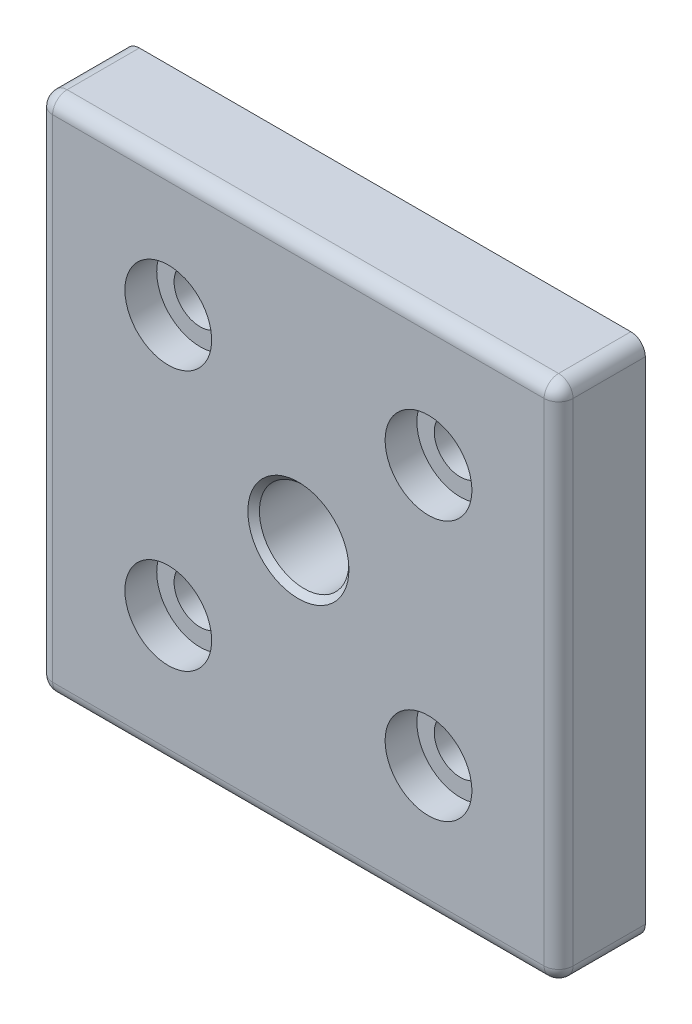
ISO-10303-21;
HEADER;
FILE_DESCRIPTION(('STEP AP214'),'2;1');
FILE_NAME('part.step','',(''),(''),'','','');
FILE_SCHEMA(('AUTOMOTIVE_DESIGN { 1 0 10303 214 1 1 1 1 }'));
ENDSEC;
DATA;
#1=APPLICATION_CONTEXT('core data for automotive mechanical design processes');
#2=APPLICATION_PROTOCOL_DEFINITION('international standard','automotive_design',2000,#1);
#3=PRODUCT_CONTEXT('',#1,'mechanical');
#4=PRODUCT('Part','Part','',(#3));
#5=PRODUCT_RELATED_PRODUCT_CATEGORY('part','',(#4));
#6=PRODUCT_DEFINITION_FORMATION('','',#4);
#7=PRODUCT_DEFINITION_CONTEXT('part definition',#1,'design');
#8=PRODUCT_DEFINITION('design','',#6,#7);
#9=PRODUCT_DEFINITION_SHAPE('','',#8);
#10=(LENGTH_UNIT() NAMED_UNIT(*) SI_UNIT(.MILLI.,.METRE.));
#11=(NAMED_UNIT(*) PLANE_ANGLE_UNIT() SI_UNIT($,.RADIAN.));
#12=(NAMED_UNIT(*) SI_UNIT($,.STERADIAN.) SOLID_ANGLE_UNIT());
#13=UNCERTAINTY_MEASURE_WITH_UNIT(LENGTH_MEASURE(1.E-05),#10,'distance_accuracy_value','');
#14=(GEOMETRIC_REPRESENTATION_CONTEXT(3) GLOBAL_UNCERTAINTY_ASSIGNED_CONTEXT((#13)) GLOBAL_UNIT_ASSIGNED_CONTEXT((#10,
#11,#12)) REPRESENTATION_CONTEXT('',''));
#15=CARTESIAN_POINT('',(0.,0.,0.));
#16=DIRECTION('',(0.,0.,1.));
#17=DIRECTION('',(1.,0.,0.));
#18=AXIS2_PLACEMENT_3D('',#15,#16,#17);
#19=CARTESIAN_POINT('',(0.,0.,15.));
#20=DIRECTION('',(0.,0.,1.));
#21=DIRECTION('',(1.,0.,0.));
#22=AXIS2_PLACEMENT_3D('',#19,#20,#21);
#23=PLANE('',#22);
#24=CARTESIAN_POINT('',(0.,0.,15.0000000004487));
#25=DIRECTION('',(0.,0.,1.));
#26=DIRECTION('',(0.,-1.,0.));
#27=AXIS2_PLACEMENT_3D('',#24,#25,#26);
#28=CIRCLE('',#27,8.73906249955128);
#29=CARTESIAN_POINT('',(0.,-8.73906249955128,15.0000000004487));
#30=VERTEX_POINT('',#29);
#31=EDGE_CURVE('E119',#30,#30,#28,.F.);
#32=ORIENTED_EDGE('',*,*,#31,.T.);
#33=EDGE_LOOP('',(#32));
#34=FACE_BOUND('',#33,.T.);
#35=CARTESIAN_POINT('',(22.5,-22.5,15.));
#36=DIRECTION('',(0.,0.,-1.));
#37=DIRECTION('',(-1.,0.,0.));
#38=AXIS2_PLACEMENT_3D('',#35,#36,#37);
#39=CIRCLE('',#38,7.5);
#40=CARTESIAN_POINT('',(15.,-22.5,15.));
#41=VERTEX_POINT('',#40);
#42=EDGE_CURVE('E123',#41,#41,#39,.T.);
#43=ORIENTED_EDGE('',*,*,#42,.T.);
#44=EDGE_LOOP('',(#43));
#45=FACE_BOUND('',#44,.T.);
#46=CARTESIAN_POINT('',(-22.5,-22.5,15.));
#47=DIRECTION('',(0.,0.,-1.));
#48=DIRECTION('',(-1.,0.,0.));
#49=AXIS2_PLACEMENT_3D('',#46,#47,#48);
#50=CIRCLE('',#49,7.5);
#51=CARTESIAN_POINT('',(-30.,-22.5,15.));
#52=VERTEX_POINT('',#51);
#53=EDGE_CURVE('E127',#52,#52,#50,.T.);
#54=ORIENTED_EDGE('',*,*,#53,.T.);
#55=EDGE_LOOP('',(#54));
#56=FACE_BOUND('',#55,.T.);
#57=CARTESIAN_POINT('',(-22.5,22.5,15.));
#58=DIRECTION('',(0.,0.,-1.));
#59=DIRECTION('',(-1.,0.,0.));
#60=AXIS2_PLACEMENT_3D('',#57,#58,#59);
#61=CIRCLE('',#60,7.5);
#62=CARTESIAN_POINT('',(-30.,22.5,15.));
#63=VERTEX_POINT('',#62);
#64=EDGE_CURVE('E19',#63,#63,#61,.T.);
#65=ORIENTED_EDGE('',*,*,#64,.T.);
#66=EDGE_LOOP('',(#65));
#67=FACE_BOUND('',#66,.T.);
#68=CARTESIAN_POINT('',(22.5,22.5,15.));
#69=DIRECTION('',(0.,0.,-1.));
#70=DIRECTION('',(-1.,0.,0.));
#71=AXIS2_PLACEMENT_3D('',#68,#69,#70);
#72=CIRCLE('',#71,7.5);
#73=CARTESIAN_POINT('',(15.,22.5,15.));
#74=VERTEX_POINT('',#73);
#75=EDGE_CURVE('E129',#74,#74,#72,.T.);
#76=ORIENTED_EDGE('',*,*,#75,.T.);
#77=EDGE_LOOP('',(#76));
#78=FACE_BOUND('',#77,.T.);
#79=DIRECTION('',(-1.,0.,0.));
#80=VECTOR('',#79,1.);
#81=CARTESIAN_POINT('',(22.5,-42.5,15.));
#82=LINE('',#81,#80);
#83=CARTESIAN_POINT('',(42.5,-42.5,15.));
#84=VERTEX_POINT('',#83);
#85=CARTESIAN_POINT('',(-42.5,-42.5,15.));
#86=VERTEX_POINT('',#85);
#87=EDGE_CURVE('E362',#84,#86,#82,.T.);
#88=ORIENTED_EDGE('',*,*,#87,.F.);
#89=DIRECTION('',(0.,-1.,0.));
#90=VECTOR('',#89,1.);
#91=CARTESIAN_POINT('',(42.5,22.5,15.));
#92=LINE('',#91,#90);
#93=CARTESIAN_POINT('',(42.5,42.5,15.));
#94=VERTEX_POINT('',#93);
#95=EDGE_CURVE('E229',#94,#84,#92,.T.);
#96=ORIENTED_EDGE('',*,*,#95,.F.);
#97=DIRECTION('',(1.,0.,0.));
#98=VECTOR('',#97,1.);
#99=CARTESIAN_POINT('',(-22.5,42.5,15.));
#100=LINE('',#99,#98);
#101=CARTESIAN_POINT('',(-42.5,42.5,15.));
#102=VERTEX_POINT('',#101);
#103=EDGE_CURVE('E126',#102,#94,#100,.T.);
#104=ORIENTED_EDGE('',*,*,#103,.F.);
#105=DIRECTION('',(0.,1.,0.));
#106=VECTOR('',#105,1.);
#107=CARTESIAN_POINT('',(-42.5,-22.5,15.));
#108=LINE('',#107,#106);
#109=EDGE_CURVE('E272',#86,#102,#108,.T.);
#110=ORIENTED_EDGE('',*,*,#109,.F.);
#111=EDGE_LOOP('',(#88,#96,#104,#110));
#112=FACE_BOUND('',#111,.T.);
#113=ADVANCED_FACE('F15',(#34,#45,#56,#67,#78,#112),#23,.T.);
#114=CARTESIAN_POINT('',(-22.5,22.5,15.));
#115=DIRECTION('',(0.,0.,-1.));
#116=DIRECTION('',(-1.,0.,0.));
#117=AXIS2_PLACEMENT_3D('',#114,#115,#116);
#118=CYLINDRICAL_SURFACE('',#117,7.5);
#119=CARTESIAN_POINT('',(-22.5,22.5,9.5));
#120=DIRECTION('',(0.,0.,-1.));
#121=DIRECTION('',(-1.,0.,0.));
#122=AXIS2_PLACEMENT_3D('',#119,#120,#121);
#123=CIRCLE('',#122,7.5);
#124=CARTESIAN_POINT('',(-30.,22.5,9.5));
#125=VERTEX_POINT('',#124);
#126=EDGE_CURVE('E116',#125,#125,#123,.T.);
#127=ORIENTED_EDGE('',*,*,#126,.T.);
#128=EDGE_LOOP('',(#127));
#129=FACE_BOUND('',#128,.T.);
#130=ORIENTED_EDGE('',*,*,#64,.F.);
#131=EDGE_LOOP('',(#130));
#132=FACE_BOUND('',#131,.T.);
#133=ADVANCED_FACE('F137',(#129,#132),#118,.F.);
#134=CARTESIAN_POINT('',(22.5,22.5,15.));
#135=DIRECTION('',(0.,0.,-1.));
#136=DIRECTION('',(-1.,0.,0.));
#137=AXIS2_PLACEMENT_3D('',#134,#135,#136);
#138=CYLINDRICAL_SURFACE('',#137,7.5);
#139=CARTESIAN_POINT('',(22.5,22.5,9.5));
#140=DIRECTION('',(0.,0.,-1.));
#141=DIRECTION('',(-1.,0.,0.));
#142=AXIS2_PLACEMENT_3D('',#139,#140,#141);
#143=CIRCLE('',#142,7.5);
#144=CARTESIAN_POINT('',(15.,22.5,9.5));
#145=VERTEX_POINT('',#144);
#146=EDGE_CURVE('E113',#145,#145,#143,.T.);
#147=ORIENTED_EDGE('',*,*,#146,.T.);
#148=EDGE_LOOP('',(#147));
#149=FACE_BOUND('',#148,.T.);
#150=ORIENTED_EDGE('',*,*,#75,.F.);
#151=EDGE_LOOP('',(#150));
#152=FACE_BOUND('',#151,.T.);
#153=ADVANCED_FACE('F139',(#149,#152),#138,.F.);
#154=CARTESIAN_POINT('',(-22.5,-22.5,15.));
#155=DIRECTION('',(0.,0.,-1.));
#156=DIRECTION('',(-1.,0.,0.));
#157=AXIS2_PLACEMENT_3D('',#154,#155,#156);
#158=CYLINDRICAL_SURFACE('',#157,7.5);
#159=CARTESIAN_POINT('',(-22.5,-22.5,9.5));
#160=DIRECTION('',(0.,0.,-1.));
#161=DIRECTION('',(-1.,0.,0.));
#162=AXIS2_PLACEMENT_3D('',#159,#160,#161);
#163=CIRCLE('',#162,7.5);
#164=CARTESIAN_POINT('',(-30.,-22.5,9.5));
#165=VERTEX_POINT('',#164);
#166=EDGE_CURVE('E110',#165,#165,#163,.T.);
#167=ORIENTED_EDGE('',*,*,#166,.T.);
#168=EDGE_LOOP('',(#167));
#169=FACE_BOUND('',#168,.T.);
#170=ORIENTED_EDGE('',*,*,#53,.F.);
#171=EDGE_LOOP('',(#170));
#172=FACE_BOUND('',#171,.T.);
#173=ADVANCED_FACE('F147',(#169,#172),#158,.F.);
#174=CARTESIAN_POINT('',(22.5,-22.5,15.));
#175=DIRECTION('',(0.,0.,-1.));
#176=DIRECTION('',(-1.,0.,0.));
#177=AXIS2_PLACEMENT_3D('',#174,#175,#176);
#178=CYLINDRICAL_SURFACE('',#177,7.5);
#179=CARTESIAN_POINT('',(22.5,-22.5,9.5));
#180=DIRECTION('',(0.,0.,-1.));
#181=DIRECTION('',(-1.,0.,0.));
#182=AXIS2_PLACEMENT_3D('',#179,#180,#181);
#183=CIRCLE('',#182,7.5);
#184=CARTESIAN_POINT('',(15.,-22.5,9.5));
#185=VERTEX_POINT('',#184);
#186=EDGE_CURVE('E106',#185,#185,#183,.T.);
#187=ORIENTED_EDGE('',*,*,#186,.T.);
#188=EDGE_LOOP('',(#187));
#189=FACE_BOUND('',#188,.T.);
#190=ORIENTED_EDGE('',*,*,#42,.F.);
#191=EDGE_LOOP('',(#190));
#192=FACE_BOUND('',#191,.T.);
#193=ADVANCED_FACE('F287',(#189,#192),#178,.F.);
#194=CARTESIAN_POINT('',(-22.5,42.5,12.5));
#195=DIRECTION('',(1.,0.,0.));
#196=DIRECTION('',(0.,1.,0.));
#197=AXIS2_PLACEMENT_3D('',#194,#195,#196);
#198=CYLINDRICAL_SURFACE('',#197,2.5);
#199=CARTESIAN_POINT('',(-42.5,42.5,12.5));
#200=DIRECTION('',(1.,0.,0.));
#201=DIRECTION('',(0.,1.,0.));
#202=AXIS2_PLACEMENT_3D('',#199,#200,#201);
#203=CIRCLE('',#202,2.5);
#204=CARTESIAN_POINT('',(-42.5,45.,12.5));
#205=VERTEX_POINT('',#204);
#206=EDGE_CURVE('E276',#102,#205,#203,.F.);
#207=ORIENTED_EDGE('',*,*,#206,.F.);
#208=ORIENTED_EDGE('',*,*,#103,.T.);
#209=CARTESIAN_POINT('',(42.5,42.5,12.5));
#210=DIRECTION('',(1.,0.,0.));
#211=DIRECTION('',(0.,1.,0.));
#212=AXIS2_PLACEMENT_3D('',#209,#210,#211);
#213=CIRCLE('',#212,2.5);
#214=CARTESIAN_POINT('',(42.5,45.,12.5));
#215=VERTEX_POINT('',#214);
#216=EDGE_CURVE('E226',#215,#94,#213,.T.);
#217=ORIENTED_EDGE('',*,*,#216,.F.);
#218=DIRECTION('',(1.,0.,0.));
#219=VECTOR('',#218,1.);
#220=CARTESIAN_POINT('',(-45.,45.,12.5));
#221=LINE('',#220,#219);
#222=EDGE_CURVE('E109',#205,#215,#221,.T.);
#223=ORIENTED_EDGE('',*,*,#222,.F.);
#224=EDGE_LOOP('',(#207,#208,#217,#223));
#225=FACE_BOUND('',#224,.T.);
#226=ADVANCED_FACE('F284',(#225),#198,.T.);
#227=CARTESIAN_POINT('',(-42.5,42.5,12.5));
#228=DIRECTION('',(1.,0.,0.));
#229=DIRECTION('',(0.,1.,0.));
#230=AXIS2_PLACEMENT_3D('',#227,#228,#229);
#231=SPHERICAL_SURFACE('',#230,2.5);
#232=ORIENTED_EDGE('',*,*,#206,.T.);
#233=CARTESIAN_POINT('',(-42.5,42.5,12.5));
#234=DIRECTION('',(0.,0.,1.));
#235=DIRECTION('',(1.,0.,0.));
#236=AXIS2_PLACEMENT_3D('',#233,#234,#235);
#237=CIRCLE('',#236,2.5);
#238=CARTESIAN_POINT('',(-45.,42.5,12.5));
#239=VERTEX_POINT('',#238);
#240=EDGE_CURVE('E232',#239,#205,#237,.F.);
#241=ORIENTED_EDGE('',*,*,#240,.F.);
#242=CARTESIAN_POINT('',(-42.5,42.5,12.5));
#243=DIRECTION('',(0.,1.,0.));
#244=DIRECTION('',(-1.,0.,0.));
#245=AXIS2_PLACEMENT_3D('',#242,#243,#244);
#246=CIRCLE('',#245,2.5);
#247=EDGE_CURVE('E273',#102,#239,#246,.F.);
#248=ORIENTED_EDGE('',*,*,#247,.F.);
#249=EDGE_LOOP('',(#232,#241,#248));
#250=FACE_BOUND('',#249,.T.);
#251=ADVANCED_FACE('F281',(#250),#231,.T.);
#252=CARTESIAN_POINT('',(-42.5,-22.5,12.5));
#253=DIRECTION('',(0.,1.,0.));
#254=DIRECTION('',(-1.,0.,0.));
#255=AXIS2_PLACEMENT_3D('',#252,#253,#254);
#256=CYLINDRICAL_SURFACE('',#255,2.5);
#257=CARTESIAN_POINT('',(-42.5,-42.5,12.5));
#258=DIRECTION('',(0.,-1.,0.));
#259=DIRECTION('',(1.,0.,0.));
#260=AXIS2_PLACEMENT_3D('',#257,#258,#259);
#261=CIRCLE('',#260,2.5);
#262=CARTESIAN_POINT('',(-45.,-42.5,12.5));
#263=VERTEX_POINT('',#262);
#264=EDGE_CURVE('E268',#86,#263,#261,.T.);
#265=ORIENTED_EDGE('',*,*,#264,.F.);
#266=ORIENTED_EDGE('',*,*,#109,.T.);
#267=ORIENTED_EDGE('',*,*,#247,.T.);
#268=DIRECTION('',(0.,1.,0.));
#269=VECTOR('',#268,1.);
#270=CARTESIAN_POINT('',(-45.,-45.,12.5));
#271=LINE('',#270,#269);
#272=EDGE_CURVE('E74',#263,#239,#271,.T.);
#273=ORIENTED_EDGE('',*,*,#272,.F.);
#274=EDGE_LOOP('',(#265,#266,#267,#273));
#275=FACE_BOUND('',#274,.T.);
#276=ADVANCED_FACE('F261',(#275),#256,.T.);
#277=CARTESIAN_POINT('',(-42.5,-42.5,12.5));
#278=DIRECTION('',(1.,0.,0.));
#279=DIRECTION('',(0.,1.,0.));
#280=AXIS2_PLACEMENT_3D('',#277,#278,#279);
#281=SPHERICAL_SURFACE('',#280,2.5);
#282=ORIENTED_EDGE('',*,*,#264,.T.);
#283=CARTESIAN_POINT('',(-42.5,-42.5,12.5));
#284=DIRECTION('',(0.,0.,1.));
#285=DIRECTION('',(1.,0.,0.));
#286=AXIS2_PLACEMENT_3D('',#283,#284,#285);
#287=CIRCLE('',#286,2.5);
#288=CARTESIAN_POINT('',(-42.5,-45.,12.5));
#289=VERTEX_POINT('',#288);
#290=EDGE_CURVE('E357',#289,#263,#287,.F.);
#291=ORIENTED_EDGE('',*,*,#290,.F.);
#292=CARTESIAN_POINT('',(-42.5,-42.5,12.5));
#293=DIRECTION('',(-1.,0.,0.));
#294=DIRECTION('',(0.,-1.,0.));
#295=AXIS2_PLACEMENT_3D('',#292,#293,#294);
#296=CIRCLE('',#295,2.5);
#297=EDGE_CURVE('E271',#86,#289,#296,.F.);
#298=ORIENTED_EDGE('',*,*,#297,.F.);
#299=EDGE_LOOP('',(#282,#291,#298));
#300=FACE_BOUND('',#299,.T.);
#301=ADVANCED_FACE('F256',(#300),#281,.T.);
#302=CARTESIAN_POINT('',(22.5,-42.5,12.5));
#303=DIRECTION('',(-1.,0.,0.));
#304=DIRECTION('',(0.,-1.,0.));
#305=AXIS2_PLACEMENT_3D('',#302,#303,#304);
#306=CYLINDRICAL_SURFACE('',#305,2.5);
#307=CARTESIAN_POINT('',(42.5,-42.5,12.5));
#308=DIRECTION('',(1.,0.,0.));
#309=DIRECTION('',(0.,1.,0.));
#310=AXIS2_PLACEMENT_3D('',#307,#308,#309);
#311=CIRCLE('',#310,2.5);
#312=CARTESIAN_POINT('',(42.5,-45.,12.5));
#313=VERTEX_POINT('',#312);
#314=EDGE_CURVE('E241',#84,#313,#311,.T.);
#315=ORIENTED_EDGE('',*,*,#314,.F.);
#316=ORIENTED_EDGE('',*,*,#87,.T.);
#317=ORIENTED_EDGE('',*,*,#297,.T.);
#318=DIRECTION('',(1.,0.,0.));
#319=VECTOR('',#318,1.);
#320=CARTESIAN_POINT('',(45.,-45.,12.5));
#321=LINE('',#320,#319);
#322=EDGE_CURVE('E242',#313,#289,#321,.F.);
#323=ORIENTED_EDGE('',*,*,#322,.F.);
#324=EDGE_LOOP('',(#315,#316,#317,#323));
#325=FACE_BOUND('',#324,.T.);
#326=ADVANCED_FACE('F252',(#325),#306,.T.);
#327=CARTESIAN_POINT('',(42.5,-42.5,12.5));
#328=DIRECTION('',(1.,0.,0.));
#329=DIRECTION('',(0.,1.,0.));
#330=AXIS2_PLACEMENT_3D('',#327,#328,#329);
#331=SPHERICAL_SURFACE('',#330,2.5);
#332=CARTESIAN_POINT('',(42.5,-42.5,12.5));
#333=DIRECTION('',(0.,-1.,0.));
#334=DIRECTION('',(0.,0.,-1.));
#335=AXIS2_PLACEMENT_3D('',#332,#333,#334);
#336=CIRCLE('',#335,2.5);
#337=CARTESIAN_POINT('',(45.,-42.5,12.5));
#338=VERTEX_POINT('',#337);
#339=EDGE_CURVE('E238',#84,#338,#336,.F.);
#340=ORIENTED_EDGE('',*,*,#339,.F.);
#341=ORIENTED_EDGE('',*,*,#314,.T.);
#342=CARTESIAN_POINT('',(42.5,-42.5,12.5));
#343=DIRECTION('',(0.,0.,1.));
#344=DIRECTION('',(1.,0.,0.));
#345=AXIS2_PLACEMENT_3D('',#342,#343,#344);
#346=CIRCLE('',#345,2.5);
#347=EDGE_CURVE('E233',#338,#313,#346,.F.);
#348=ORIENTED_EDGE('',*,*,#347,.F.);
#349=EDGE_LOOP('',(#340,#341,#348));
#350=FACE_BOUND('',#349,.T.);
#351=ADVANCED_FACE('F249',(#350),#331,.T.);
#352=CARTESIAN_POINT('',(42.5,22.5,12.5));
#353=DIRECTION('',(0.,-1.,0.));
#354=DIRECTION('',(0.,0.,-1.));
#355=AXIS2_PLACEMENT_3D('',#352,#353,#354);
#356=CYLINDRICAL_SURFACE('',#355,2.5);
#357=CARTESIAN_POINT('',(42.5,42.5,12.5));
#358=DIRECTION('',(0.,-1.,0.));
#359=DIRECTION('',(1.,0.,0.));
#360=AXIS2_PLACEMENT_3D('',#357,#358,#359);
#361=CIRCLE('',#360,2.5);
#362=CARTESIAN_POINT('',(45.,42.5,12.5));
#363=VERTEX_POINT('',#362);
#364=EDGE_CURVE('E122',#94,#363,#361,.F.);
#365=ORIENTED_EDGE('',*,*,#364,.F.);
#366=ORIENTED_EDGE('',*,*,#95,.T.);
#367=ORIENTED_EDGE('',*,*,#339,.T.);
#368=DIRECTION('',(0.,1.,0.));
#369=VECTOR('',#368,1.);
#370=CARTESIAN_POINT('',(45.,45.,12.5));
#371=LINE('',#370,#369);
#372=EDGE_CURVE('E341',#363,#338,#371,.F.);
#373=ORIENTED_EDGE('',*,*,#372,.F.);
#374=EDGE_LOOP('',(#365,#366,#367,#373));
#375=FACE_BOUND('',#374,.T.);
#376=ADVANCED_FACE('F216',(#375),#356,.T.);
#377=CARTESIAN_POINT('',(42.5,42.5,12.5));
#378=DIRECTION('',(1.,0.,0.));
#379=DIRECTION('',(0.,1.,0.));
#380=AXIS2_PLACEMENT_3D('',#377,#378,#379);
#381=SPHERICAL_SURFACE('',#380,2.5);
#382=ORIENTED_EDGE('',*,*,#216,.T.);
#383=ORIENTED_EDGE('',*,*,#364,.T.);
#384=CARTESIAN_POINT('',(42.5,42.5,12.5));
#385=DIRECTION('',(0.,0.,1.));
#386=DIRECTION('',(1.,0.,0.));
#387=AXIS2_PLACEMENT_3D('',#384,#385,#386);
#388=CIRCLE('',#387,2.5);
#389=EDGE_CURVE('E222',#215,#363,#388,.F.);
#390=ORIENTED_EDGE('',*,*,#389,.F.);
#391=EDGE_LOOP('',(#382,#383,#390));
#392=FACE_BOUND('',#391,.T.);
#393=ADVANCED_FACE('F211',(#392),#381,.T.);
#394=CARTESIAN_POINT('',(0.,0.,15.0000000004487));
#395=DIRECTION('',(0.,0.,1.));
#396=DIRECTION('',(0.,-1.,0.));
#397=AXIS2_PLACEMENT_3D('',#394,#395,#396);
#398=CONICAL_SURFACE('',#397,8.73906249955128,0.7853981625);
#399=ORIENTED_EDGE('',*,*,#31,.F.);
#400=EDGE_LOOP('',(#399));
#401=FACE_BOUND('',#400,.T.);
#402=CARTESIAN_POINT('',(0.,0.,14.));
#403=DIRECTION('',(0.,0.,1.));
#404=DIRECTION('',(1.,0.,0.));
#405=AXIS2_PLACEMENT_3D('',#402,#403,#404);
#406=CIRCLE('',#405,7.7390625);
#407=CARTESIAN_POINT('',(7.7390625,0.,14.));
#408=VERTEX_POINT('',#407);
#409=EDGE_CURVE('E105',#408,#408,#406,.F.);
#410=ORIENTED_EDGE('',*,*,#409,.T.);
#411=EDGE_LOOP('',(#410));
#412=FACE_BOUND('',#411,.T.);
#413=ADVANCED_FACE('F207',(#401,#412),#398,.F.);
#414=CARTESIAN_POINT('',(-30.15,30.15,9.5));
#415=DIRECTION('',(0.,0.,-1.));
#416=DIRECTION('',(1.,0.,0.));
#417=AXIS2_PLACEMENT_3D('',#414,#415,#416);
#418=PLANE('',#417);
#419=CARTESIAN_POINT('',(-22.5,22.5,9.5));
#420=DIRECTION('',(0.,0.,1.));
#421=DIRECTION('',(1.,0.,0.));
#422=AXIS2_PLACEMENT_3D('',#419,#420,#421);
#423=CIRCLE('',#422,4.5);
#424=CARTESIAN_POINT('',(-18.,22.5,9.5));
#425=VERTEX_POINT('',#424);
#426=EDGE_CURVE('E102',#425,#425,#423,.F.);
#427=ORIENTED_EDGE('',*,*,#426,.T.);
#428=EDGE_LOOP('',(#427));
#429=FACE_BOUND('',#428,.T.);
#430=ORIENTED_EDGE('',*,*,#126,.F.);
#431=EDGE_LOOP('',(#430));
#432=FACE_BOUND('',#431,.T.);
#433=ADVANCED_FACE('F210',(#429,#432),#418,.F.);
#434=CARTESIAN_POINT('',(14.85,30.15,9.5));
#435=DIRECTION('',(0.,0.,-1.));
#436=DIRECTION('',(1.,0.,0.));
#437=AXIS2_PLACEMENT_3D('',#434,#435,#436);
#438=PLANE('',#437);
#439=CARTESIAN_POINT('',(22.5,22.5,9.5));
#440=DIRECTION('',(0.,0.,1.));
#441=DIRECTION('',(1.,0.,0.));
#442=AXIS2_PLACEMENT_3D('',#439,#440,#441);
#443=CIRCLE('',#442,4.5);
#444=CARTESIAN_POINT('',(27.,22.5,9.5));
#445=VERTEX_POINT('',#444);
#446=EDGE_CURVE('E99',#445,#445,#443,.F.);
#447=ORIENTED_EDGE('',*,*,#446,.T.);
#448=EDGE_LOOP('',(#447));
#449=FACE_BOUND('',#448,.T.);
#450=ORIENTED_EDGE('',*,*,#146,.F.);
#451=EDGE_LOOP('',(#450));
#452=FACE_BOUND('',#451,.T.);
#453=ADVANCED_FACE('F400',(#449,#452),#438,.F.);
#454=CARTESIAN_POINT('',(-30.15,-14.85,9.5));
#455=DIRECTION('',(0.,0.,-1.));
#456=DIRECTION('',(1.,0.,0.));
#457=AXIS2_PLACEMENT_3D('',#454,#455,#456);
#458=PLANE('',#457);
#459=CARTESIAN_POINT('',(-22.5,-22.5,9.5));
#460=DIRECTION('',(0.,0.,1.));
#461=DIRECTION('',(1.,0.,0.));
#462=AXIS2_PLACEMENT_3D('',#459,#460,#461);
#463=CIRCLE('',#462,4.5);
#464=CARTESIAN_POINT('',(-18.,-22.5,9.5));
#465=VERTEX_POINT('',#464);
#466=EDGE_CURVE('E96',#465,#465,#463,.F.);
#467=ORIENTED_EDGE('',*,*,#466,.T.);
#468=EDGE_LOOP('',(#467));
#469=FACE_BOUND('',#468,.T.);
#470=ORIENTED_EDGE('',*,*,#166,.F.);
#471=EDGE_LOOP('',(#470));
#472=FACE_BOUND('',#471,.T.);
#473=ADVANCED_FACE('F406',(#469,#472),#458,.F.);
#474=CARTESIAN_POINT('',(14.85,-14.85,9.5));
#475=DIRECTION('',(0.,0.,-1.));
#476=DIRECTION('',(1.,0.,0.));
#477=AXIS2_PLACEMENT_3D('',#474,#475,#476);
#478=PLANE('',#477);
#479=CARTESIAN_POINT('',(22.5,-22.5,9.5));
#480=DIRECTION('',(0.,0.,1.));
#481=DIRECTION('',(1.,0.,0.));
#482=AXIS2_PLACEMENT_3D('',#479,#480,#481);
#483=CIRCLE('',#482,4.5);
#484=CARTESIAN_POINT('',(27.,-22.5,9.5));
#485=VERTEX_POINT('',#484);
#486=EDGE_CURVE('E89',#485,#485,#483,.F.);
#487=ORIENTED_EDGE('',*,*,#486,.T.);
#488=EDGE_LOOP('',(#487));
#489=FACE_BOUND('',#488,.T.);
#490=ORIENTED_EDGE('',*,*,#186,.F.);
#491=EDGE_LOOP('',(#490));
#492=FACE_BOUND('',#491,.T.);
#493=ADVANCED_FACE('F17',(#489,#492),#478,.F.);
#494=CARTESIAN_POINT('',(-45.,45.,0.));
#495=DIRECTION('',(0.,1.,0.));
#496=DIRECTION('',(0.,0.,1.));
#497=AXIS2_PLACEMENT_3D('',#494,#495,#496);
#498=PLANE('',#497);
#499=DIRECTION('',(0.,0.,1.));
#500=VECTOR('',#499,1.);
#501=CARTESIAN_POINT('',(-42.5,45.,0.));
#502=LINE('',#501,#500);
#503=CARTESIAN_POINT('',(-42.5,45.,0.));
#504=VERTEX_POINT('',#503);
#505=EDGE_CURVE('E60',#205,#504,#502,.F.);
#506=ORIENTED_EDGE('',*,*,#505,.F.);
#507=ORIENTED_EDGE('',*,*,#222,.T.);
#508=DIRECTION('',(0.,0.,1.));
#509=VECTOR('',#508,1.);
#510=CARTESIAN_POINT('',(42.5,45.,0.));
#511=LINE('',#510,#509);
#512=CARTESIAN_POINT('',(42.5,45.,0.));
#513=VERTEX_POINT('',#512);
#514=EDGE_CURVE('E339',#513,#215,#511,.T.);
#515=ORIENTED_EDGE('',*,*,#514,.F.);
#516=DIRECTION('',(1.,0.,0.));
#517=VECTOR('',#516,1.);
#518=CARTESIAN_POINT('',(0.,45.,0.));
#519=LINE('',#518,#517);
#520=EDGE_CURVE('E87',#513,#504,#519,.F.);
#521=ORIENTED_EDGE('',*,*,#520,.T.);
#522=EDGE_LOOP('',(#506,#507,#515,#521));
#523=FACE_BOUND('',#522,.T.);
#524=ADVANCED_FACE('F203',(#523),#498,.T.);
#525=CARTESIAN_POINT('',(-42.5,42.5,0.));
#526=DIRECTION('',(0.,0.,1.));
#527=DIRECTION('',(1.,0.,0.));
#528=AXIS2_PLACEMENT_3D('',#525,#526,#527);
#529=CYLINDRICAL_SURFACE('',#528,2.5);
#530=ORIENTED_EDGE('',*,*,#240,.T.);
#531=ORIENTED_EDGE('',*,*,#505,.T.);
#532=CARTESIAN_POINT('',(-42.5,42.5,0.));
#533=DIRECTION('',(0.,0.,1.));
#534=DIRECTION('',(1.,0.,0.));
#535=AXIS2_PLACEMENT_3D('',#532,#533,#534);
#536=CIRCLE('',#535,2.5);
#537=CARTESIAN_POINT('',(-45.,42.5,0.));
#538=VERTEX_POINT('',#537);
#539=EDGE_CURVE('E80',#504,#538,#536,.T.);
#540=ORIENTED_EDGE('',*,*,#539,.T.);
#541=DIRECTION('',(0.,0.,1.));
#542=VECTOR('',#541,1.);
#543=CARTESIAN_POINT('',(-45.,42.5,0.));
#544=LINE('',#543,#542);
#545=EDGE_CURVE('E67',#239,#538,#544,.F.);
#546=ORIENTED_EDGE('',*,*,#545,.F.);
#547=EDGE_LOOP('',(#530,#531,#540,#546));
#548=FACE_BOUND('',#547,.T.);
#549=ADVANCED_FACE('F86',(#548),#529,.T.);
#550=CARTESIAN_POINT('',(-45.,-45.,0.));
#551=DIRECTION('',(-1.,0.,0.));
#552=DIRECTION('',(0.,0.,1.));
#553=AXIS2_PLACEMENT_3D('',#550,#551,#552);
#554=PLANE('',#553);
#555=DIRECTION('',(0.,0.,1.));
#556=VECTOR('',#555,1.);
#557=CARTESIAN_POINT('',(-45.,-42.5,0.));
#558=LINE('',#557,#556);
#559=CARTESIAN_POINT('',(-45.,-42.5,0.));
#560=VERTEX_POINT('',#559);
#561=EDGE_CURVE('E245',#263,#560,#558,.F.);
#562=ORIENTED_EDGE('',*,*,#561,.F.);
#563=ORIENTED_EDGE('',*,*,#272,.T.);
#564=ORIENTED_EDGE('',*,*,#545,.T.);
#565=DIRECTION('',(0.,1.,0.));
#566=VECTOR('',#565,1.);
#567=CARTESIAN_POINT('',(-45.,0.,0.));
#568=LINE('',#567,#566);
#569=EDGE_CURVE('E71',#538,#560,#568,.F.);
#570=ORIENTED_EDGE('',*,*,#569,.T.);
#571=EDGE_LOOP('',(#562,#563,#564,#570));
#572=FACE_BOUND('',#571,.T.);
#573=ADVANCED_FACE('F70',(#572),#554,.T.);
#574=CARTESIAN_POINT('',(-42.5,-42.5,0.));
#575=DIRECTION('',(0.,0.,1.));
#576=DIRECTION('',(1.,0.,0.));
#577=AXIS2_PLACEMENT_3D('',#574,#575,#576);
#578=CYLINDRICAL_SURFACE('',#577,2.5);
#579=ORIENTED_EDGE('',*,*,#290,.T.);
#580=ORIENTED_EDGE('',*,*,#561,.T.);
#581=CARTESIAN_POINT('',(-42.5,-42.5,0.));
#582=DIRECTION('',(0.,0.,1.));
#583=DIRECTION('',(1.,0.,0.));
#584=AXIS2_PLACEMENT_3D('',#581,#582,#583);
#585=CIRCLE('',#584,2.5);
#586=CARTESIAN_POINT('',(-42.5,-45.,0.));
#587=VERTEX_POINT('',#586);
#588=EDGE_CURVE('E84',#560,#587,#585,.T.);
#589=ORIENTED_EDGE('',*,*,#588,.T.);
#590=DIRECTION('',(0.,0.,-1.));
#591=VECTOR('',#590,1.);
#592=CARTESIAN_POINT('',(-42.5,-45.,0.));
#593=LINE('',#592,#591);
#594=EDGE_CURVE('E237',#289,#587,#593,.T.);
#595=ORIENTED_EDGE('',*,*,#594,.F.);
#596=EDGE_LOOP('',(#579,#580,#589,#595));
#597=FACE_BOUND('',#596,.T.);
#598=ADVANCED_FACE('F194',(#597),#578,.T.);
#599=CARTESIAN_POINT('',(45.,-45.,0.));
#600=DIRECTION('',(0.,-1.,0.));
#601=DIRECTION('',(0.,0.,-1.));
#602=AXIS2_PLACEMENT_3D('',#599,#600,#601);
#603=PLANE('',#602);
#604=ORIENTED_EDGE('',*,*,#594,.T.);
#605=DIRECTION('',(1.,0.,0.));
#606=VECTOR('',#605,1.);
#607=CARTESIAN_POINT('',(0.,-45.,0.));
#608=LINE('',#607,#606);
#609=CARTESIAN_POINT('',(42.5,-45.,0.));
#610=VERTEX_POINT('',#609);
#611=EDGE_CURVE('E383',#587,#610,#608,.T.);
#612=ORIENTED_EDGE('',*,*,#611,.T.);
#613=DIRECTION('',(0.,0.,1.));
#614=VECTOR('',#613,1.);
#615=CARTESIAN_POINT('',(42.5,-45.,0.));
#616=LINE('',#615,#614);
#617=EDGE_CURVE('E236',#313,#610,#616,.F.);
#618=ORIENTED_EDGE('',*,*,#617,.F.);
#619=ORIENTED_EDGE('',*,*,#322,.T.);
#620=EDGE_LOOP('',(#604,#612,#618,#619));
#621=FACE_BOUND('',#620,.T.);
#622=ADVANCED_FACE('F190',(#621),#603,.T.);
#623=CARTESIAN_POINT('',(42.5,-42.5,0.));
#624=DIRECTION('',(0.,0.,1.));
#625=DIRECTION('',(1.,0.,0.));
#626=AXIS2_PLACEMENT_3D('',#623,#624,#625);
#627=CYLINDRICAL_SURFACE('',#626,2.5);
#628=ORIENTED_EDGE('',*,*,#347,.T.);
#629=ORIENTED_EDGE('',*,*,#617,.T.);
#630=CARTESIAN_POINT('',(42.5,-42.5,0.));
#631=DIRECTION('',(0.,0.,1.));
#632=DIRECTION('',(1.,0.,0.));
#633=AXIS2_PLACEMENT_3D('',#630,#631,#632);
#634=CIRCLE('',#633,2.5);
#635=CARTESIAN_POINT('',(45.,-42.5,0.));
#636=VERTEX_POINT('',#635);
#637=EDGE_CURVE('E381',#610,#636,#634,.T.);
#638=ORIENTED_EDGE('',*,*,#637,.T.);
#639=DIRECTION('',(0.,0.,-1.));
#640=VECTOR('',#639,1.);
#641=CARTESIAN_POINT('',(45.,-42.5,0.));
#642=LINE('',#641,#640);
#643=EDGE_CURVE('E344',#338,#636,#642,.T.);
#644=ORIENTED_EDGE('',*,*,#643,.F.);
#645=EDGE_LOOP('',(#628,#629,#638,#644));
#646=FACE_BOUND('',#645,.T.);
#647=ADVANCED_FACE('F186',(#646),#627,.T.);
#648=CARTESIAN_POINT('',(45.,45.,0.));
#649=DIRECTION('',(1.,0.,0.));
#650=DIRECTION('',(0.,0.,-1.));
#651=AXIS2_PLACEMENT_3D('',#648,#649,#650);
#652=PLANE('',#651);
#653=ORIENTED_EDGE('',*,*,#643,.T.);
#654=DIRECTION('',(0.,1.,0.));
#655=VECTOR('',#654,1.);
#656=CARTESIAN_POINT('',(45.,0.,0.));
#657=LINE('',#656,#655);
#658=CARTESIAN_POINT('',(45.,42.5,0.));
#659=VERTEX_POINT('',#658);
#660=EDGE_CURVE('E346',#636,#659,#657,.T.);
#661=ORIENTED_EDGE('',*,*,#660,.T.);
#662=DIRECTION('',(0.,0.,1.));
#663=VECTOR('',#662,1.);
#664=CARTESIAN_POINT('',(45.,42.5,0.));
#665=LINE('',#664,#663);
#666=EDGE_CURVE('E34',#363,#659,#665,.F.);
#667=ORIENTED_EDGE('',*,*,#666,.F.);
#668=ORIENTED_EDGE('',*,*,#372,.T.);
#669=EDGE_LOOP('',(#653,#661,#667,#668));
#670=FACE_BOUND('',#669,.T.);
#671=ADVANCED_FACE('F183',(#670),#652,.T.);
#672=CARTESIAN_POINT('',(42.5,42.5,0.));
#673=DIRECTION('',(0.,0.,1.));
#674=DIRECTION('',(1.,0.,0.));
#675=AXIS2_PLACEMENT_3D('',#672,#673,#674);
#676=CYLINDRICAL_SURFACE('',#675,2.5);
#677=ORIENTED_EDGE('',*,*,#389,.T.);
#678=ORIENTED_EDGE('',*,*,#666,.T.);
#679=CARTESIAN_POINT('',(42.5,42.5,0.));
#680=DIRECTION('',(0.,0.,1.));
#681=DIRECTION('',(1.,0.,0.));
#682=AXIS2_PLACEMENT_3D('',#679,#680,#681);
#683=CIRCLE('',#682,2.5);
#684=EDGE_CURVE('E380',#659,#513,#683,.T.);
#685=ORIENTED_EDGE('',*,*,#684,.T.);
#686=ORIENTED_EDGE('',*,*,#514,.T.);
#687=EDGE_LOOP('',(#677,#678,#685,#686));
#688=FACE_BOUND('',#687,.T.);
#689=ADVANCED_FACE('F179',(#688),#676,.T.);
#690=CARTESIAN_POINT('',(0.,0.,0.));
#691=DIRECTION('',(0.,0.,1.));
#692=DIRECTION('',(1.,0.,0.));
#693=AXIS2_PLACEMENT_3D('',#690,#691,#692);
#694=CYLINDRICAL_SURFACE('',#693,7.7390625);
#695=ORIENTED_EDGE('',*,*,#409,.F.);
#696=EDGE_LOOP('',(#695));
#697=FACE_BOUND('',#696,.T.);
#698=CARTESIAN_POINT('',(0.,0.,0.));
#699=DIRECTION('',(0.,0.,1.));
#700=DIRECTION('',(1.,0.,0.));
#701=AXIS2_PLACEMENT_3D('',#698,#699,#700);
#702=CIRCLE('',#701,7.7390625);
#703=CARTESIAN_POINT('',(7.7390625,0.,0.));
#704=VERTEX_POINT('',#703);
#705=EDGE_CURVE('E377',#704,#704,#702,.F.);
#706=ORIENTED_EDGE('',*,*,#705,.T.);
#707=EDGE_LOOP('',(#706));
#708=FACE_BOUND('',#707,.T.);
#709=ADVANCED_FACE('F175',(#697,#708),#694,.F.);
#710=CARTESIAN_POINT('',(-22.5,22.5,0.));
#711=DIRECTION('',(0.,0.,1.));
#712=DIRECTION('',(1.,0.,0.));
#713=AXIS2_PLACEMENT_3D('',#710,#711,#712);
#714=CYLINDRICAL_SURFACE('',#713,4.5);
#715=CARTESIAN_POINT('',(-22.5,22.5,0.));
#716=DIRECTION('',(0.,0.,1.));
#717=DIRECTION('',(1.,0.,0.));
#718=AXIS2_PLACEMENT_3D('',#715,#716,#717);
#719=CIRCLE('',#718,4.5);
#720=CARTESIAN_POINT('',(-18.,22.5,0.));
#721=VERTEX_POINT('',#720);
#722=EDGE_CURVE('E374',#721,#721,#719,.F.);
#723=ORIENTED_EDGE('',*,*,#722,.T.);
#724=EDGE_LOOP('',(#723));
#725=FACE_BOUND('',#724,.T.);
#726=ORIENTED_EDGE('',*,*,#426,.F.);
#727=EDGE_LOOP('',(#726));
#728=FACE_BOUND('',#727,.T.);
#729=ADVANCED_FACE('F171',(#725,#728),#714,.F.);
#730=CARTESIAN_POINT('',(22.5,22.5,0.));
#731=DIRECTION('',(0.,0.,1.));
#732=DIRECTION('',(1.,0.,0.));
#733=AXIS2_PLACEMENT_3D('',#730,#731,#732);
#734=CYLINDRICAL_SURFACE('',#733,4.5);
#735=CARTESIAN_POINT('',(22.5,22.5,0.));
#736=DIRECTION('',(0.,0.,1.));
#737=DIRECTION('',(1.,0.,0.));
#738=AXIS2_PLACEMENT_3D('',#735,#736,#737);
#739=CIRCLE('',#738,4.5);
#740=CARTESIAN_POINT('',(27.,22.5,0.));
#741=VERTEX_POINT('',#740);
#742=EDGE_CURVE('E371',#741,#741,#739,.F.);
#743=ORIENTED_EDGE('',*,*,#742,.T.);
#744=EDGE_LOOP('',(#743));
#745=FACE_BOUND('',#744,.T.);
#746=ORIENTED_EDGE('',*,*,#446,.F.);
#747=EDGE_LOOP('',(#746));
#748=FACE_BOUND('',#747,.T.);
#749=ADVANCED_FACE('F167',(#745,#748),#734,.F.);
#750=CARTESIAN_POINT('',(-22.5,-22.5,0.));
#751=DIRECTION('',(0.,0.,1.));
#752=DIRECTION('',(1.,0.,0.));
#753=AXIS2_PLACEMENT_3D('',#750,#751,#752);
#754=CYLINDRICAL_SURFACE('',#753,4.5);
#755=CARTESIAN_POINT('',(-22.5,-22.5,0.));
#756=DIRECTION('',(0.,0.,1.));
#757=DIRECTION('',(1.,0.,0.));
#758=AXIS2_PLACEMENT_3D('',#755,#756,#757);
#759=CIRCLE('',#758,4.5);
#760=CARTESIAN_POINT('',(-18.,-22.5,0.));
#761=VERTEX_POINT('',#760);
#762=EDGE_CURVE('E25',#761,#761,#759,.F.);
#763=ORIENTED_EDGE('',*,*,#762,.T.);
#764=EDGE_LOOP('',(#763));
#765=FACE_BOUND('',#764,.T.);
#766=ORIENTED_EDGE('',*,*,#466,.F.);
#767=EDGE_LOOP('',(#766));
#768=FACE_BOUND('',#767,.T.);
#769=ADVANCED_FACE('F159',(#765,#768),#754,.F.);
#770=CARTESIAN_POINT('',(22.5,-22.5,0.));
#771=DIRECTION('',(0.,0.,1.));
#772=DIRECTION('',(1.,0.,0.));
#773=AXIS2_PLACEMENT_3D('',#770,#771,#772);
#774=CYLINDRICAL_SURFACE('',#773,4.5);
#775=CARTESIAN_POINT('',(22.5,-22.5,0.));
#776=DIRECTION('',(0.,0.,1.));
#777=DIRECTION('',(1.,0.,0.));
#778=AXIS2_PLACEMENT_3D('',#775,#776,#777);
#779=CIRCLE('',#778,4.5);
#780=CARTESIAN_POINT('',(27.,-22.5,0.));
#781=VERTEX_POINT('',#780);
#782=EDGE_CURVE('E10',#781,#781,#779,.F.);
#783=ORIENTED_EDGE('',*,*,#782,.T.);
#784=EDGE_LOOP('',(#783));
#785=FACE_BOUND('',#784,.T.);
#786=ORIENTED_EDGE('',*,*,#486,.F.);
#787=EDGE_LOOP('',(#786));
#788=FACE_BOUND('',#787,.T.);
#789=ADVANCED_FACE('F153',(#785,#788),#774,.F.);
#790=CARTESIAN_POINT('',(0.,0.,0.));
#791=DIRECTION('',(0.,0.,1.));
#792=DIRECTION('',(1.,0.,0.));
#793=AXIS2_PLACEMENT_3D('',#790,#791,#792);
#794=PLANE('',#793);
#795=ORIENTED_EDGE('',*,*,#782,.F.);
#796=EDGE_LOOP('',(#795));
#797=FACE_BOUND('',#796,.T.);
#798=ORIENTED_EDGE('',*,*,#762,.F.);
#799=EDGE_LOOP('',(#798));
#800=FACE_BOUND('',#799,.T.);
#801=ORIENTED_EDGE('',*,*,#742,.F.);
#802=EDGE_LOOP('',(#801));
#803=FACE_BOUND('',#802,.T.);
#804=ORIENTED_EDGE('',*,*,#722,.F.);
#805=EDGE_LOOP('',(#804));
#806=FACE_BOUND('',#805,.T.);
#807=ORIENTED_EDGE('',*,*,#705,.F.);
#808=EDGE_LOOP('',(#807));
#809=FACE_BOUND('',#808,.T.);
#810=ORIENTED_EDGE('',*,*,#660,.F.);
#811=ORIENTED_EDGE('',*,*,#637,.F.);
#812=ORIENTED_EDGE('',*,*,#611,.F.);
#813=ORIENTED_EDGE('',*,*,#588,.F.);
#814=ORIENTED_EDGE('',*,*,#569,.F.);
#815=ORIENTED_EDGE('',*,*,#539,.F.);
#816=ORIENTED_EDGE('',*,*,#520,.F.);
#817=ORIENTED_EDGE('',*,*,#684,.F.);
#818=EDGE_LOOP('',(#810,#811,#812,#813,#814,#815,#816,#817));
#819=FACE_BOUND('',#818,.T.);
#820=ADVANCED_FACE('F79',(#797,#800,#803,#806,#809,#819),#794,.F.);
#821=CLOSED_SHELL('',(#113,#133,#153,#173,#193,#226,#251,#276,#301,#326,#351,#376,#393,#413,
#433,#453,#473,#493,#524,#549,#573,#598,#622,#647,#671,#689,#709,#729,#749,#769,#789,#820));
#822=MANIFOLD_SOLID_BREP('B1',#821);
#823=ADVANCED_BREP_SHAPE_REPRESENTATION('',(#18,#822),#14);
#824=SHAPE_DEFINITION_REPRESENTATION(#9,#823);
ENDSEC;
END-ISO-10303-21;
